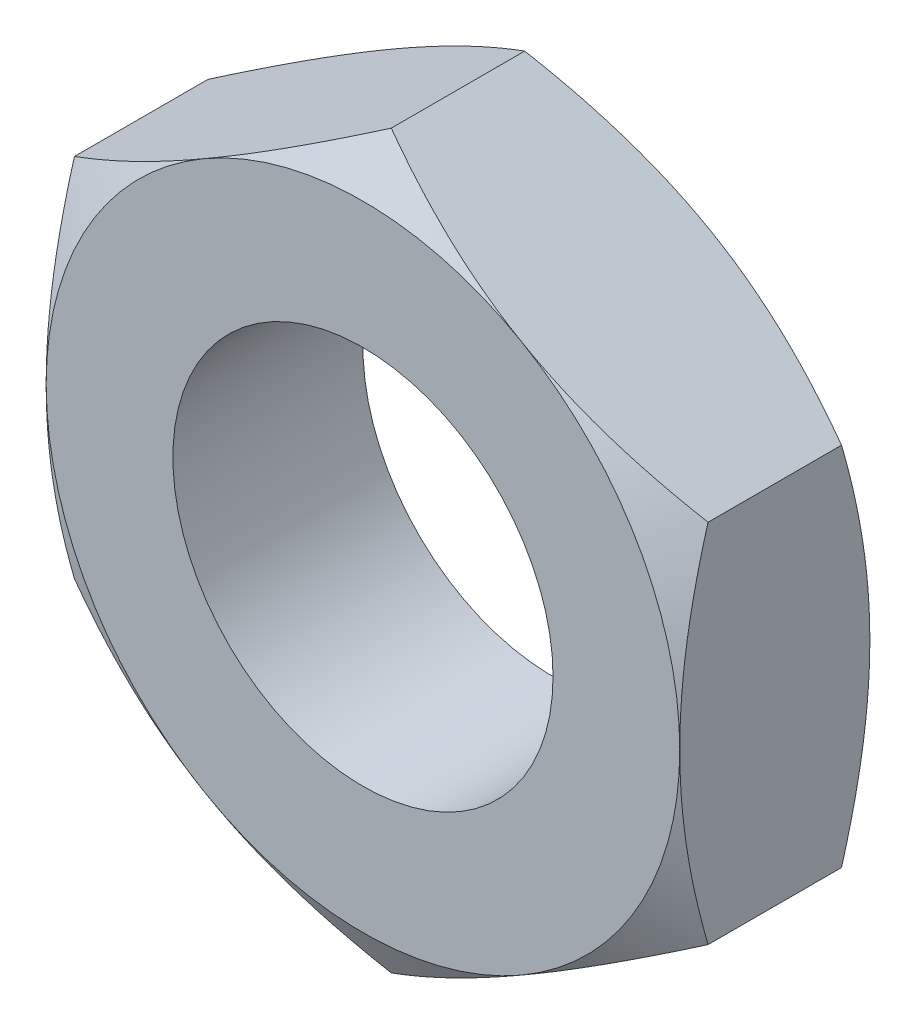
ISO-10303-21;
HEADER;
FILE_DESCRIPTION(('STEP AP214'),'2;1');
FILE_NAME('part.step','',(''),(''),'','','');
FILE_SCHEMA(('AUTOMOTIVE_DESIGN { 1 0 10303 214 1 1 1 1 }'));
ENDSEC;
DATA;
#1=APPLICATION_CONTEXT('core data for automotive mechanical design processes');
#2=APPLICATION_PROTOCOL_DEFINITION('international standard','automotive_design',2000,#1);
#3=PRODUCT_CONTEXT('',#1,'mechanical');
#4=PRODUCT('Part','Part','',(#3));
#5=PRODUCT_RELATED_PRODUCT_CATEGORY('part','',(#4));
#6=PRODUCT_DEFINITION_FORMATION('','',#4);
#7=PRODUCT_DEFINITION_CONTEXT('part definition',#1,'design');
#8=PRODUCT_DEFINITION('design','',#6,#7);
#9=PRODUCT_DEFINITION_SHAPE('','',#8);
#10=(LENGTH_UNIT() NAMED_UNIT(*) SI_UNIT(.MILLI.,.METRE.));
#11=(NAMED_UNIT(*) PLANE_ANGLE_UNIT() SI_UNIT($,.RADIAN.));
#12=(NAMED_UNIT(*) SI_UNIT($,.STERADIAN.) SOLID_ANGLE_UNIT());
#13=UNCERTAINTY_MEASURE_WITH_UNIT(LENGTH_MEASURE(1.E-05),#10,'distance_accuracy_value','');
#14=(GEOMETRIC_REPRESENTATION_CONTEXT(3) GLOBAL_UNCERTAINTY_ASSIGNED_CONTEXT((#13)) GLOBAL_UNIT_ASSIGNED_CONTEXT((#10,
#11,#12)) REPRESENTATION_CONTEXT('',''));
#15=CARTESIAN_POINT('',(0.,0.,0.));
#16=DIRECTION('',(0.,0.,1.));
#17=DIRECTION('',(1.,0.,0.));
#18=AXIS2_PLACEMENT_3D('',#15,#16,#17);
#19=CARTESIAN_POINT('',(-10.,0.,3.));
#20=DIRECTION('',(0.,0.,-1.));
#21=DIRECTION('',(-1.,0.,0.));
#22=AXIS2_PLACEMENT_3D('',#19,#20,#21);
#23=PLANE('',#22);
#24=CARTESIAN_POINT('',(0.,0.,3.));
#25=DIRECTION('',(0.,0.,-1.));
#26=DIRECTION('',(-1.,0.,0.));
#27=AXIS2_PLACEMENT_3D('',#24,#25,#26);
#28=CIRCLE('',#27,5.);
#29=CARTESIAN_POINT('',(-5.,0.,3.));
#30=VERTEX_POINT('',#29);
#31=CARTESIAN_POINT('',(-2.50000000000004,4.33012701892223,3.));
#32=VERTEX_POINT('',#31);
#33=EDGE_CURVE('E137',#30,#32,#28,.T.);
#34=ORIENTED_EDGE('',*,*,#33,.F.);
#35=CARTESIAN_POINT('',(-2.5,-4.33012701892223,3.));
#36=VERTEX_POINT('',#35);
#37=EDGE_CURVE('E119',#36,#30,#28,.T.);
#38=ORIENTED_EDGE('',*,*,#37,.F.);
#39=CARTESIAN_POINT('',(2.5,-4.33012701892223,3.));
#40=VERTEX_POINT('',#39);
#41=EDGE_CURVE('E109',#40,#36,#28,.T.);
#42=ORIENTED_EDGE('',*,*,#41,.F.);
#43=CARTESIAN_POINT('',(5.,0.,3.));
#44=VERTEX_POINT('',#43);
#45=EDGE_CURVE('E36',#44,#40,#28,.T.);
#46=ORIENTED_EDGE('',*,*,#45,.F.);
#47=CARTESIAN_POINT('',(2.50000000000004,4.33012701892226,3.));
#48=VERTEX_POINT('',#47);
#49=EDGE_CURVE('E44',#48,#44,#28,.T.);
#50=ORIENTED_EDGE('',*,*,#49,.F.);
#51=EDGE_CURVE('E139',#32,#48,#28,.T.);
#52=ORIENTED_EDGE('',*,*,#51,.F.);
#53=EDGE_LOOP('',(#34,#38,#42,#46,#50,#52));
#54=FACE_BOUND('',#53,.T.);
#55=CARTESIAN_POINT('',(0.,0.,3.));
#56=DIRECTION('',(0.,0.,1.));
#57=DIRECTION('',(1.,0.,0.));
#58=AXIS2_PLACEMENT_3D('',#55,#56,#57);
#59=CIRCLE('',#58,3.);
#60=CARTESIAN_POINT('',(3.,0.,3.));
#61=VERTEX_POINT('',#60);
#62=EDGE_CURVE('E293',#61,#61,#59,.T.);
#63=ORIENTED_EDGE('',*,*,#62,.F.);
#64=EDGE_LOOP('',(#63));
#65=FACE_BOUND('',#64,.T.);
#66=ADVANCED_FACE('F14',(#54,#65),#23,.F.);
#67=CARTESIAN_POINT('',(-10.,0.,0.));
#68=DIRECTION('',(0.,0.,-1.));
#69=DIRECTION('',(-1.,0.,0.));
#70=AXIS2_PLACEMENT_3D('',#67,#68,#69);
#71=PLANE('',#70);
#72=CARTESIAN_POINT('',(0.,0.,0.));
#73=DIRECTION('',(0.,0.,-1.));
#74=DIRECTION('',(-1.,0.,0.));
#75=AXIS2_PLACEMENT_3D('',#72,#73,#74);
#76=CIRCLE('',#75,5.);
#77=CARTESIAN_POINT('',(-2.5,-4.33012701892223,0.));
#78=VERTEX_POINT('',#77);
#79=CARTESIAN_POINT('',(-5.,0.,0.));
#80=VERTEX_POINT('',#79);
#81=EDGE_CURVE('E251',#78,#80,#76,.T.);
#82=ORIENTED_EDGE('',*,*,#81,.T.);
#83=CARTESIAN_POINT('',(-2.5,4.33012701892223,0.));
#84=VERTEX_POINT('',#83);
#85=EDGE_CURVE('E216',#80,#84,#76,.T.);
#86=ORIENTED_EDGE('',*,*,#85,.T.);
#87=CARTESIAN_POINT('',(2.50000000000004,4.33012701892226,0.));
#88=VERTEX_POINT('',#87);
#89=EDGE_CURVE('E258',#84,#88,#76,.T.);
#90=ORIENTED_EDGE('',*,*,#89,.T.);
#91=CARTESIAN_POINT('',(5.,0.,0.));
#92=VERTEX_POINT('',#91);
#93=EDGE_CURVE('E260',#88,#92,#76,.T.);
#94=ORIENTED_EDGE('',*,*,#93,.T.);
#95=CARTESIAN_POINT('',(2.5,-4.33012701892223,0.));
#96=VERTEX_POINT('',#95);
#97=EDGE_CURVE('E257',#92,#96,#76,.T.);
#98=ORIENTED_EDGE('',*,*,#97,.T.);
#99=EDGE_CURVE('E253',#96,#78,#76,.T.);
#100=ORIENTED_EDGE('',*,*,#99,.T.);
#101=EDGE_LOOP('',(#82,#86,#90,#94,#98,#100));
#102=FACE_BOUND('',#101,.T.);
#103=CARTESIAN_POINT('',(0.,0.,0.));
#104=DIRECTION('',(0.,0.,1.));
#105=DIRECTION('',(1.,0.,0.));
#106=AXIS2_PLACEMENT_3D('',#103,#104,#105);
#107=CIRCLE('',#106,3.);
#108=CARTESIAN_POINT('',(3.,0.,0.));
#109=VERTEX_POINT('',#108);
#110=EDGE_CURVE('E287',#109,#109,#107,.T.);
#111=ORIENTED_EDGE('',*,*,#110,.T.);
#112=EDGE_LOOP('',(#111));
#113=FACE_BOUND('',#112,.T.);
#114=ADVANCED_FACE('F264',(#102,#113),#71,.T.);
#115=CARTESIAN_POINT('',(-5.,-2.88675134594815,3.));
#116=DIRECTION('',(0.5,0.866025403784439,0.));
#117=DIRECTION('',(-0.866025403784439,0.5,0.));
#118=AXIS2_PLACEMENT_3D('',#115,#116,#117);
#119=PLANE('',#118);
#120=DIRECTION('',(0.,0.,-1.));
#121=VECTOR('',#120,1.);
#122=CARTESIAN_POINT('',(0.,-5.77350269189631,3.));
#123=LINE('',#122,#121);
#124=CARTESIAN_POINT('',(0.,-5.77350269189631,2.55341801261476));
#125=VERTEX_POINT('',#124);
#126=CARTESIAN_POINT('',(0.,-5.77350269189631,0.446581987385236));
#127=VERTEX_POINT('',#126);
#128=EDGE_CURVE('E133',#125,#127,#123,.T.);
#129=ORIENTED_EDGE('',*,*,#128,.F.);
#130=CARTESIAN_POINT('',(0.000200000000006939,-5.77361816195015,2.55335134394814));
#131=CARTESIAN_POINT('',(-0.219534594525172,-5.64675433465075,2.62661343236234));
#132=CARTESIAN_POINT('',(-0.441148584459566,-5.51880543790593,2.69324867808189));
#133=CARTESIAN_POINT('',(-0.8882139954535,-5.2606921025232,2.80956100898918));
#134=CARTESIAN_POINT('',(-1.11367335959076,-5.13052307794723,2.8591969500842));
#135=CARTESIAN_POINT('',(-1.5618323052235,-4.87177839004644,2.93644897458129));
#136=CARTESIAN_POINT('',(-1.78446209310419,-4.74324302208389,2.9645796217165));
#137=CARTESIAN_POINT('',(-2.11918990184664,-4.54998783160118,2.98980507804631));
#138=CARTESIAN_POINT('',(-2.23084219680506,-4.48552534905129,2.99538654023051));
#139=CARTESIAN_POINT('',(-2.4542499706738,-4.35654081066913,3.00079778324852));
#140=CARTESIAN_POINT('',(-2.56600544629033,-4.29201875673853,3.00062774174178));
#141=CARTESIAN_POINT('',(-2.87218423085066,-4.11524635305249,2.99224636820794));
#142=CARTESIAN_POINT('',(-3.06650608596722,-4.00305457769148,2.97817022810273));
#143=CARTESIAN_POINT('',(-3.45386010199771,-3.77941563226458,2.93353474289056));
#144=CARTESIAN_POINT('',(-3.64689090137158,-3.6679692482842,2.90296013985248));
#145=CARTESIAN_POINT('',(-4.03502534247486,-3.44387972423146,2.82653150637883));
#146=CARTESIAN_POINT('',(-4.23007999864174,-3.33126486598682,2.78035362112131));
#147=CARTESIAN_POINT('',(-4.61728034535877,-3.10771464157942,2.67554820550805));
#148=CARTESIAN_POINT('',(-4.80943099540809,-2.99677641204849,2.61694529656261));
#149=CARTESIAN_POINT('',(-5.0002,-2.88663587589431,2.55335134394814));
#150=B_SPLINE_CURVE_WITH_KNOTS('',3,(#130,#131,#132,#133,#134,#135,#136,#137,#138,#139,#140,
#141,#142,#143,#144,#145,#146,#147,#148,#149),.UNSPECIFIED.,.F.,.F.,(4,2,2,2,2,2,2,2,2,4),(0.,
0.792555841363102,1.58701660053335,2.36181537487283,2.74884076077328,3.13585419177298,
3.80962362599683,4.48401723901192,5.17336882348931,5.86136694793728),.UNSPECIFIED.);
#151=EDGE_CURVE('E113',#125,#36,#150,.T.);
#152=ORIENTED_EDGE('',*,*,#151,.T.);
#153=CARTESIAN_POINT('',(-5.,-2.88675134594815,2.55341801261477));
#154=VERTEX_POINT('',#153);
#155=EDGE_CURVE('E124',#36,#154,#150,.T.);
#156=ORIENTED_EDGE('',*,*,#155,.T.);
#157=DIRECTION('',(0.,0.,-1.));
#158=VECTOR('',#157,1.);
#159=CARTESIAN_POINT('',(-5.,-2.88675134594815,3.));
#160=LINE('',#159,#158);
#161=CARTESIAN_POINT('',(-5.,-2.88675134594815,0.446581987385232));
#162=VERTEX_POINT('',#161);
#163=EDGE_CURVE('E296',#154,#162,#160,.T.);
#164=ORIENTED_EDGE('',*,*,#163,.T.);
#165=CARTESIAN_POINT('',(-5.0002,-2.88663587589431,0.446648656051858));
#166=CARTESIAN_POINT('',(-4.78046540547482,-3.0134997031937,0.373386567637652));
#167=CARTESIAN_POINT('',(-4.55885141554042,-3.14144859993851,0.306751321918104));
#168=CARTESIAN_POINT('',(-4.11178600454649,-3.39956193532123,0.190438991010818));
#169=CARTESIAN_POINT('',(-3.88632664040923,-3.5297309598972,0.140803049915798));
#170=CARTESIAN_POINT('',(-3.43816769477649,-3.788475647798,0.0635510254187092));
#171=CARTESIAN_POINT('',(-3.21553790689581,-3.91701101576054,0.0354203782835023));
#172=CARTESIAN_POINT('',(-2.88081009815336,-4.11026620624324,0.0101949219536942));
#173=CARTESIAN_POINT('',(-2.76915780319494,-4.17472868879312,0.0046134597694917));
#174=CARTESIAN_POINT('',(-2.54575002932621,-4.3037132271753,-0.000797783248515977));
#175=CARTESIAN_POINT('',(-2.4339945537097,-4.36823528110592,-0.000627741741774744));
#176=CARTESIAN_POINT('',(-2.12781576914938,-4.54500768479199,0.00775363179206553));
#177=CARTESIAN_POINT('',(-1.93349391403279,-4.65719946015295,0.0218297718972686));
#178=CARTESIAN_POINT('',(-1.54613989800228,-4.88083840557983,0.0664652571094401));
#179=CARTESIAN_POINT('',(-1.35310909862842,-4.99228478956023,0.0970398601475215));
#180=CARTESIAN_POINT('',(-0.964974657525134,-5.21637431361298,0.173468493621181));
#181=CARTESIAN_POINT('',(-0.76992000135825,-5.32898917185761,0.219646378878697));
#182=CARTESIAN_POINT('',(-0.382719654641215,-5.55253939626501,0.324451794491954));
#183=CARTESIAN_POINT('',(-0.190569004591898,-5.66347762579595,0.383054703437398));
#184=CARTESIAN_POINT('',(0.000200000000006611,-5.77361816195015,0.446648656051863));
#185=B_SPLINE_CURVE_WITH_KNOTS('',3,(#165,#166,#167,#168,#169,#170,#171,#172,#173,#174,#175,
#176,#177,#178,#179,#180,#181,#182,#183,#184),.UNSPECIFIED.,.F.,.F.,(4,2,2,2,2,2,2,2,2,4),(0.,
0.792555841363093,1.58701660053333,2.3618153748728,2.74884076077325,3.13585419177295,
3.8096236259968,4.48401723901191,5.17336882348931,5.86136694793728),.UNSPECIFIED.);
#186=EDGE_CURVE('E284',#162,#78,#185,.T.);
#187=ORIENTED_EDGE('',*,*,#186,.T.);
#188=EDGE_CURVE('E282',#78,#127,#185,.T.);
#189=ORIENTED_EDGE('',*,*,#188,.T.);
#190=EDGE_LOOP('',(#129,#152,#156,#164,#187,#189));
#191=FACE_BOUND('',#190,.T.);
#192=ADVANCED_FACE('F16',(#191),#119,.F.);
#193=CARTESIAN_POINT('',(0.,-5.77350269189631,3.));
#194=DIRECTION('',(-0.5,0.866025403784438,0.));
#195=DIRECTION('',(-0.866025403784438,-0.5,0.));
#196=AXIS2_PLACEMENT_3D('',#193,#194,#195);
#197=PLANE('',#196);
#198=DIRECTION('',(0.,0.,-1.));
#199=VECTOR('',#198,1.);
#200=CARTESIAN_POINT('',(5.,-2.88675134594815,3.));
#201=LINE('',#200,#199);
#202=CARTESIAN_POINT('',(5.,-2.88675134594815,2.55341801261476));
#203=VERTEX_POINT('',#202);
#204=CARTESIAN_POINT('',(5.,-2.88675134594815,0.446581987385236));
#205=VERTEX_POINT('',#204);
#206=EDGE_CURVE('E279',#203,#205,#201,.T.);
#207=ORIENTED_EDGE('',*,*,#206,.F.);
#208=CARTESIAN_POINT('',(5.0002,-2.88663587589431,2.55335134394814));
#209=CARTESIAN_POINT('',(4.78046540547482,-3.01349970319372,2.62661343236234));
#210=CARTESIAN_POINT('',(4.55885141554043,-3.14144859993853,2.69324867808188));
#211=CARTESIAN_POINT('',(4.1117860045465,-3.39956193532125,2.80956100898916));
#212=CARTESIAN_POINT('',(3.88632664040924,-3.52973095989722,2.85919695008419));
#213=CARTESIAN_POINT('',(3.43816769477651,-3.78847564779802,2.93644897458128));
#214=CARTESIAN_POINT('',(3.21553790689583,-3.91701101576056,2.96457962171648));
#215=CARTESIAN_POINT('',(2.88081009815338,-4.11026620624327,2.98980507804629));
#216=CARTESIAN_POINT('',(2.76915780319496,-4.17472868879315,2.99538654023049));
#217=CARTESIAN_POINT('',(2.54575002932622,-4.30371322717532,3.0007977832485));
#218=CARTESIAN_POINT('',(2.43399455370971,-4.36823528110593,3.00062774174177));
#219=CARTESIAN_POINT('',(2.12781576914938,-4.54500768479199,2.99224636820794));
#220=CARTESIAN_POINT('',(1.93349391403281,-4.65719946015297,2.97817022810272));
#221=CARTESIAN_POINT('',(1.54613989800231,-4.88083840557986,2.93353474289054));
#222=CARTESIAN_POINT('',(1.35310909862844,-4.99228478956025,2.90296013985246));
#223=CARTESIAN_POINT('',(0.964974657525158,-5.216374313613,2.82653150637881));
#224=CARTESIAN_POINT('',(0.769920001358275,-5.32898917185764,2.78035362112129));
#225=CARTESIAN_POINT('',(0.38271965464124,-5.55253939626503,2.67554820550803));
#226=CARTESIAN_POINT('',(0.190569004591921,-5.66347762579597,2.61694529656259));
#227=CARTESIAN_POINT('',(-0.000199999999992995,-5.77361816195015,2.55335134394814));
#228=B_SPLINE_CURVE_WITH_KNOTS('',3,(#208,#209,#210,#211,#212,#213,#214,#215,#216,#217,#218,
#219,#220,#221,#222,#223,#224,#225,#226,#227),.UNSPECIFIED.,.F.,.F.,(4,2,2,2,2,2,2,2,2,4),(0.,
0.792555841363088,1.58701660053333,2.3618153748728,2.74884076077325,3.13585419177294,
3.80962362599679,4.48401723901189,5.17336882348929,5.86136694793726),.UNSPECIFIED.);
#229=EDGE_CURVE('E157',#203,#40,#228,.T.);
#230=ORIENTED_EDGE('',*,*,#229,.T.);
#231=EDGE_CURVE('E115',#40,#125,#228,.T.);
#232=ORIENTED_EDGE('',*,*,#231,.T.);
#233=ORIENTED_EDGE('',*,*,#128,.T.);
#234=CARTESIAN_POINT('',(-0.000199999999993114,-5.77361816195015,0.446648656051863));
#235=CARTESIAN_POINT('',(0.219534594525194,-5.64675433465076,0.373386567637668));
#236=CARTESIAN_POINT('',(0.441148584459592,-5.51880543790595,0.306751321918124));
#237=CARTESIAN_POINT('',(0.88821399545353,-5.26069210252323,0.190438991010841));
#238=CARTESIAN_POINT('',(1.11367335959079,-5.13052307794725,0.140803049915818));
#239=CARTESIAN_POINT('',(1.56183230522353,-4.87177839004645,0.0635510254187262));
#240=CARTESIAN_POINT('',(1.78446209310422,-4.74324302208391,0.0354203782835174));
#241=CARTESIAN_POINT('',(2.11918990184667,-4.5499878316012,0.0101949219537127));
#242=CARTESIAN_POINT('',(2.23084219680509,-4.48552534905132,0.00461345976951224));
#243=CARTESIAN_POINT('',(2.45424997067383,-4.35654081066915,-0.000797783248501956));
#244=CARTESIAN_POINT('',(2.56600544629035,-4.29201875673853,-0.000627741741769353));
#245=CARTESIAN_POINT('',(2.87218423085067,-4.11524635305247,0.00775363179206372));
#246=CARTESIAN_POINT('',(3.06650608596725,-4.0030545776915,0.02182977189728));
#247=CARTESIAN_POINT('',(3.45386010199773,-3.77941563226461,0.0664652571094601));
#248=CARTESIAN_POINT('',(3.6468909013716,-3.66796924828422,0.0970398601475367));
#249=CARTESIAN_POINT('',(4.03502534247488,-3.44387972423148,0.173468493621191));
#250=CARTESIAN_POINT('',(4.23007999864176,-3.33126486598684,0.219646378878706));
#251=CARTESIAN_POINT('',(4.61728034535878,-3.10771464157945,0.324451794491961));
#252=CARTESIAN_POINT('',(4.8094309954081,-2.99677641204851,0.383054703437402));
#253=CARTESIAN_POINT('',(5.0002,-2.88663587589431,0.446648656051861));
#254=B_SPLINE_CURVE_WITH_KNOTS('',3,(#234,#235,#236,#237,#238,#239,#240,#241,#242,#243,#244,
#245,#246,#247,#248,#249,#250,#251,#252,#253),.UNSPECIFIED.,.F.,.F.,(4,2,2,2,2,2,2,2,2,4),(0.,
0.7925558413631,1.58701660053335,2.36181537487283,2.74884076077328,3.13585419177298,
3.80962362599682,4.48401723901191,5.1733688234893,5.86136694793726),.UNSPECIFIED.);
#255=EDGE_CURVE('E280',#127,#96,#254,.T.);
#256=ORIENTED_EDGE('',*,*,#255,.T.);
#257=EDGE_CURVE('E232',#96,#205,#254,.T.);
#258=ORIENTED_EDGE('',*,*,#257,.T.);
#259=EDGE_LOOP('',(#207,#230,#232,#233,#256,#258));
#260=FACE_BOUND('',#259,.T.);
#261=ADVANCED_FACE('F241',(#260),#197,.F.);
#262=CARTESIAN_POINT('',(5.,-2.88675134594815,3.));
#263=DIRECTION('',(-1.,0.,0.));
#264=DIRECTION('',(0.,-1.,0.));
#265=AXIS2_PLACEMENT_3D('',#262,#263,#264);
#266=PLANE('',#265);
#267=DIRECTION('',(0.,0.,-1.));
#268=VECTOR('',#267,1.);
#269=CARTESIAN_POINT('',(5.,2.88675134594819,3.));
#270=LINE('',#269,#268);
#271=CARTESIAN_POINT('',(5.,2.88675134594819,2.55341801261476));
#272=VERTEX_POINT('',#271);
#273=CARTESIAN_POINT('',(5.,2.88675134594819,0.446581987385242));
#274=VERTEX_POINT('',#273);
#275=EDGE_CURVE('E303',#272,#274,#270,.T.);
#276=ORIENTED_EDGE('',*,*,#275,.F.);
#277=CARTESIAN_POINT('',(5.,-7.70435628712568,0.584012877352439));
#278=CARTESIAN_POINT('',(5.,-7.48638862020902,0.689545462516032));
#279=CARTESIAN_POINT('',(5.00000000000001,-7.26791520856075,0.79405164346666));
#280=CARTESIAN_POINT('',(5.00000000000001,-6.8296877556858,1.0004329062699));
#281=CARTESIAN_POINT('',(5.00000000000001,-6.60993351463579,1.10230756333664));
#282=CARTESIAN_POINT('',(5.,-6.1677188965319,1.30337074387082));
#283=CARTESIAN_POINT('',(5.,-5.94525026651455,1.40254117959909));
#284=CARTESIAN_POINT('',(5.,-5.49852605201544,1.596756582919));
#285=CARTESIAN_POINT('',(5.,-5.27427055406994,1.69180174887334));
#286=CARTESIAN_POINT('',(5.,-4.81656719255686,1.87956746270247));
#287=CARTESIAN_POINT('',(5.,-4.5830510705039,1.97212254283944));
#288=CARTESIAN_POINT('',(5.,-4.11326842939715,2.15010633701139));
#289=CARTESIAN_POINT('',(5.,-3.8770016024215,2.23553424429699));
#290=CARTESIAN_POINT('',(5.,-3.40180035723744,2.39698443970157));
#291=CARTESIAN_POINT('',(5.,-3.16287262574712,2.47302620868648));
#292=CARTESIAN_POINT('',(5.,-2.68159049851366,2.61323118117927));
#293=CARTESIAN_POINT('',(5.,-2.43923722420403,2.6773981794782));
#294=CARTESIAN_POINT('',(5.,-1.95230484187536,2.79040234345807));
#295=CARTESIAN_POINT('',(5.,-1.70774498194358,2.83932090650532));
#296=CARTESIAN_POINT('',(5.,-1.2156368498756,2.91902977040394));
#297=CARTESIAN_POINT('',(5.,-0.968088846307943,2.94982168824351));
#298=CARTESIAN_POINT('',(5.,-0.474452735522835,2.99041678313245));
#299=CARTESIAN_POINT('',(5.,-0.228387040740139,3.00048579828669));
#300=CARTESIAN_POINT('',(5.,0.263719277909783,2.99947816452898));
#301=CARTESIAN_POINT('',(5.,0.509759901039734,2.98840101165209));
#302=CARTESIAN_POINT('',(5.,0.928963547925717,2.95228919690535));
#303=CARTESIAN_POINT('',(5.,1.10258008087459,2.93223058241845));
#304=CARTESIAN_POINT('',(4.99999999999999,1.44850164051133,2.88286018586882));
#305=CARTESIAN_POINT('',(4.99999999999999,1.6208064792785,2.85354710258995));
#306=CARTESIAN_POINT('',(5.,2.13554732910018,2.75327119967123));
#307=CARTESIAN_POINT('',(4.99999999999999,2.47560842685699,2.66999132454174));
#308=CARTESIAN_POINT('',(4.99999999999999,2.98401548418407,2.52610224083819));
#309=CARTESIAN_POINT('',(4.99999999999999,3.15500999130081,2.47432265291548));
#310=CARTESIAN_POINT('',(4.99999999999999,3.49533709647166,2.36551539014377));
#311=CARTESIAN_POINT('',(4.99999999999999,3.66466968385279,2.30848768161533));
#312=CARTESIAN_POINT('',(4.99999999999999,4.00172905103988,2.1900884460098));
#313=CARTESIAN_POINT('',(4.99999999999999,4.16945636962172,2.12871843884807));
#314=CARTESIAN_POINT('',(4.99999999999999,4.50353028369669,2.00234359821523));
#315=CARTESIAN_POINT('',(5.,4.66987689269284,1.93733880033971));
#316=CARTESIAN_POINT('',(5.,5.05103159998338,1.7843571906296));
#317=CARTESIAN_POINT('',(4.99999999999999,5.2654193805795,1.69533532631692));
#318=CARTESIAN_POINT('',(4.99999999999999,5.69246162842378,1.51321637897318));
#319=CARTESIAN_POINT('',(4.99999999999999,5.90511600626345,1.42011908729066));
#320=CARTESIAN_POINT('',(4.99999999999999,6.32899635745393,1.23063721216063));
#321=CARTESIAN_POINT('',(4.99999999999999,6.54022207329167,1.13425205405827));
#322=CARTESIAN_POINT('',(4.99999999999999,6.9614414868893,0.938822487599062));
#323=CARTESIAN_POINT('',(4.99999999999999,7.17143516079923,0.839778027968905));
#324=CARTESIAN_POINT('',(4.99999999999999,7.80023947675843,0.539224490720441));
#325=CARTESIAN_POINT('',(4.99999999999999,8.21749619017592,0.334466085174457));
#326=CARTESIAN_POINT('',(4.99999999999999,9.04903998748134,-0.0809933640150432));
#327=CARTESIAN_POINT('',(4.99999999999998,9.46332696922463,-0.291694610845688));
#328=CARTESIAN_POINT('',(4.99999999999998,10.0666982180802,-0.602498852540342));
#329=CARTESIAN_POINT('',(4.99999999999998,10.2566518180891,-0.700919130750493));
#330=CARTESIAN_POINT('',(4.99999999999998,10.6361445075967,-0.898547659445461));
#331=CARTESIAN_POINT('',(4.99999999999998,10.8256836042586,-0.99775589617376));
#332=CARTESIAN_POINT('',(4.99999999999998,11.3937758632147,-1.29641369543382));
#333=CARTESIAN_POINT('',(4.99999999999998,11.771789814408,-1.49688902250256));
#334=CARTESIAN_POINT('',(4.99999999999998,12.5258364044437,-1.89947578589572));
#335=CARTESIAN_POINT('',(4.99999999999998,12.9018715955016,-2.10158245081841));
#336=CARTESIAN_POINT('',(4.99999999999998,13.6530235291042,-2.50745083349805));
#337=CARTESIAN_POINT('',(4.99999999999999,14.0281403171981,-2.71121246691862));
#338=CARTESIAN_POINT('',(5.,14.4029155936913,-2.91559640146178));
#339=B_SPLINE_CURVE_WITH_KNOTS('',3,(#277,#278,#279,#280,#281,#282,#283,#284,#285,#286,#287,
#288,#289,#290,#291,#292,#293,#294,#295,#296,#297,#298,#299,#300,#301,#302,#303,#304,#305,#306,
#307,#308,#309,#310,#311,#312,#313,#314,#315,#316,#317,#318,#319,#320,#321,#322,#323,#324,#325,
#326,#327,#328,#329,#330,#331,#332,#333,#334,#335,#336,#337,#338),.UNSPECIFIED.,.F.,.F.,(4,2,2,
2,2,2,2,2,2,2,2,2,2,2,2,2,2,2,2,2,2,2,2,2,2,2,2,2,2,2,4),(0.,0.726523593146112,1.45316373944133,
2.18384467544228,2.91449043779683,3.66796939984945,4.42153353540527,5.17350637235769,
5.92523848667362,6.672886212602,7.42046723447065,8.15839678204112,8.89634391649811,
9.42040292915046,9.94453565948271,10.9934049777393,11.5293484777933,12.0652954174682,
12.601055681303,13.1368106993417,13.8331624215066,14.5295498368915,15.2260595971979,
15.922582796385,17.3168712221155,18.7112073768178,19.3530160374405,19.9948135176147,
21.2784563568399,22.5591730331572,23.8398248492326),.UNSPECIFIED.);
#340=EDGE_CURVE('E153',#272,#44,#339,.F.);
#341=ORIENTED_EDGE('',*,*,#340,.T.);
#342=EDGE_CURVE('E156',#44,#203,#339,.F.);
#343=ORIENTED_EDGE('',*,*,#342,.T.);
#344=ORIENTED_EDGE('',*,*,#206,.T.);
#345=CARTESIAN_POINT('',(5.,-7.70435628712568,2.41598712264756));
#346=CARTESIAN_POINT('',(5.,-7.48638862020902,2.31045453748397));
#347=CARTESIAN_POINT('',(5.00000000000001,-7.26791520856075,2.20594835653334));
#348=CARTESIAN_POINT('',(5.00000000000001,-6.82968775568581,1.9995670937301));
#349=CARTESIAN_POINT('',(5.00000000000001,-6.60993351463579,1.89769243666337));
#350=CARTESIAN_POINT('',(5.,-6.1677188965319,1.69662925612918));
#351=CARTESIAN_POINT('',(5.,-5.94525026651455,1.59745882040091));
#352=CARTESIAN_POINT('',(5.,-5.49852605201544,1.403243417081));
#353=CARTESIAN_POINT('',(5.,-5.27427055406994,1.30819825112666));
#354=CARTESIAN_POINT('',(5.,-4.81656719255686,1.12043253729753));
#355=CARTESIAN_POINT('',(5.,-4.5830510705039,1.02787745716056));
#356=CARTESIAN_POINT('',(5.,-4.11326842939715,0.84989366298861));
#357=CARTESIAN_POINT('',(5.,-3.8770016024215,0.764465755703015));
#358=CARTESIAN_POINT('',(5.,-3.40180035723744,0.60301556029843));
#359=CARTESIAN_POINT('',(5.,-3.16287262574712,0.526973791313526));
#360=CARTESIAN_POINT('',(5.,-2.68159049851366,0.386768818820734));
#361=CARTESIAN_POINT('',(5.,-2.43923722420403,0.322601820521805));
#362=CARTESIAN_POINT('',(5.,-1.95230484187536,0.209597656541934));
#363=CARTESIAN_POINT('',(5.,-1.70774498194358,0.160679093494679));
#364=CARTESIAN_POINT('',(5.,-1.2156368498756,0.0809702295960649));
#365=CARTESIAN_POINT('',(5.,-0.968088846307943,0.050178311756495));
#366=CARTESIAN_POINT('',(5.,-0.474452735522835,0.00958321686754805));
#367=CARTESIAN_POINT('',(5.,-0.228387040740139,-0.000485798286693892));
#368=CARTESIAN_POINT('',(5.,0.263719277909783,0.000521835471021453));
#369=CARTESIAN_POINT('',(5.,0.509759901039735,0.0115989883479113));
#370=CARTESIAN_POINT('',(5.,0.928963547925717,0.0477108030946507));
#371=CARTESIAN_POINT('',(5.,1.10258008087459,0.0677694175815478));
#372=CARTESIAN_POINT('',(4.99999999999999,1.44850164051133,0.117139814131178));
#373=CARTESIAN_POINT('',(4.99999999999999,1.6208064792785,0.146452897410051));
#374=CARTESIAN_POINT('',(5.,2.13554732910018,0.246728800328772));
#375=CARTESIAN_POINT('',(4.99999999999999,2.47560842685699,0.330008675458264));
#376=CARTESIAN_POINT('',(4.99999999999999,2.98401548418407,0.473897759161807));
#377=CARTESIAN_POINT('',(4.99999999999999,3.15500999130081,0.525677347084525));
#378=CARTESIAN_POINT('',(4.99999999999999,3.49533709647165,0.634484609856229));
#379=CARTESIAN_POINT('',(4.99999999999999,3.66466968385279,0.691512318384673));
#380=CARTESIAN_POINT('',(4.99999999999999,4.00172905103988,0.809911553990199));
#381=CARTESIAN_POINT('',(4.99999999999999,4.16945636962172,0.871281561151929));
#382=CARTESIAN_POINT('',(4.99999999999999,4.50353028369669,0.997656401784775));
#383=CARTESIAN_POINT('',(5.,4.66987689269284,1.06266119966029));
#384=CARTESIAN_POINT('',(5.,5.05103159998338,1.2156428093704));
#385=CARTESIAN_POINT('',(4.99999999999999,5.2654193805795,1.30466467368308));
#386=CARTESIAN_POINT('',(4.99999999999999,5.69246162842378,1.48678362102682));
#387=CARTESIAN_POINT('',(4.99999999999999,5.90511600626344,1.57988091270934));
#388=CARTESIAN_POINT('',(4.99999999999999,6.32899635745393,1.76936278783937));
#389=CARTESIAN_POINT('',(4.99999999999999,6.54022207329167,1.86574794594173));
#390=CARTESIAN_POINT('',(4.99999999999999,6.96144148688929,2.06117751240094));
#391=CARTESIAN_POINT('',(4.99999999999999,7.17143516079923,2.16022197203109));
#392=CARTESIAN_POINT('',(4.99999999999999,7.80023947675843,2.46077550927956));
#393=CARTESIAN_POINT('',(4.99999999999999,8.21749619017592,2.66553391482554));
#394=CARTESIAN_POINT('',(4.99999999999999,9.04903998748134,3.08099336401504));
#395=CARTESIAN_POINT('',(4.99999999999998,9.46332696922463,3.29169461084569));
#396=CARTESIAN_POINT('',(4.99999999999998,10.0666982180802,3.60249885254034));
#397=CARTESIAN_POINT('',(4.99999999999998,10.2566518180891,3.70091913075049));
#398=CARTESIAN_POINT('',(4.99999999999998,10.6361445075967,3.89854765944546));
#399=CARTESIAN_POINT('',(4.99999999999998,10.8256836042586,3.99775589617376));
#400=CARTESIAN_POINT('',(4.99999999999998,11.3937758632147,4.29641369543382));
#401=CARTESIAN_POINT('',(4.99999999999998,11.771789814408,4.49688902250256));
#402=CARTESIAN_POINT('',(4.99999999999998,12.5258364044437,4.89947578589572));
#403=CARTESIAN_POINT('',(4.99999999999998,12.9018715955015,5.10158245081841));
#404=CARTESIAN_POINT('',(4.99999999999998,13.6530235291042,5.50745083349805));
#405=CARTESIAN_POINT('',(4.99999999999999,14.0281403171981,5.71121246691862));
#406=CARTESIAN_POINT('',(5.,14.4029155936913,5.91559640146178));
#407=B_SPLINE_CURVE_WITH_KNOTS('',3,(#345,#346,#347,#348,#349,#350,#351,#352,#353,#354,#355,
#356,#357,#358,#359,#360,#361,#362,#363,#364,#365,#366,#367,#368,#369,#370,#371,#372,#373,#374,
#375,#376,#377,#378,#379,#380,#381,#382,#383,#384,#385,#386,#387,#388,#389,#390,#391,#392,#393,
#394,#395,#396,#397,#398,#399,#400,#401,#402,#403,#404,#405,#406),.UNSPECIFIED.,.F.,.F.,(4,2,2,
2,2,2,2,2,2,2,2,2,2,2,2,2,2,2,2,2,2,2,2,2,2,2,2,2,2,2,4),(0.,0.726523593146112,1.45316373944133,
2.18384467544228,2.91449043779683,3.66796939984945,4.42153353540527,5.17350637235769,
5.92523848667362,6.672886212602,7.42046723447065,8.15839678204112,8.89634391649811,
9.42040292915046,9.94453565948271,10.9934049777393,11.5293484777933,12.0652954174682,
12.601055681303,13.1368106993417,13.8331624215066,14.5295498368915,15.2260595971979,
15.922582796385,17.3168712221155,18.7112073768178,19.3530160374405,19.9948135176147,
21.2784563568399,22.5591730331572,23.8398248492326),.UNSPECIFIED.);
#408=EDGE_CURVE('E231',#205,#92,#407,.T.);
#409=ORIENTED_EDGE('',*,*,#408,.T.);
#410=EDGE_CURVE('E224',#92,#274,#407,.T.);
#411=ORIENTED_EDGE('',*,*,#410,.T.);
#412=EDGE_LOOP('',(#276,#341,#343,#344,#409,#411));
#413=FACE_BOUND('',#412,.T.);
#414=ADVANCED_FACE('F238',(#413),#266,.F.);
#415=CARTESIAN_POINT('',(5.,2.88675134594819,3.));
#416=DIRECTION('',(-0.5,-0.866025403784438,0.));
#417=DIRECTION('',(0.866025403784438,-0.5,0.));
#418=AXIS2_PLACEMENT_3D('',#415,#416,#417);
#419=PLANE('',#418);
#420=DIRECTION('',(0.,0.,-1.));
#421=VECTOR('',#420,1.);
#422=CARTESIAN_POINT('',(0.,5.77350269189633,3.));
#423=LINE('',#422,#421);
#424=CARTESIAN_POINT('',(0.,5.77350269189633,2.55341801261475));
#425=VERTEX_POINT('',#424);
#426=CARTESIAN_POINT('',(0.,5.77350269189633,0.446581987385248));
#427=VERTEX_POINT('',#426);
#428=EDGE_CURVE('E162',#425,#427,#423,.T.);
#429=ORIENTED_EDGE('',*,*,#428,.F.);
#430=CARTESIAN_POINT('',(-0.000199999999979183,5.77361816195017,2.55335134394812));
#431=CARTESIAN_POINT('',(0.219534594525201,5.64675433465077,2.62661343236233));
#432=CARTESIAN_POINT('',(0.441148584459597,5.51880543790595,2.69324867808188));
#433=CARTESIAN_POINT('',(0.888213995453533,5.26069210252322,2.80956100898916));
#434=CARTESIAN_POINT('',(1.1136733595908,5.13052307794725,2.85919695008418));
#435=CARTESIAN_POINT('',(1.56183230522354,4.87177839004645,2.93644897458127));
#436=CARTESIAN_POINT('',(1.78446209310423,4.74324302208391,2.96457962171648));
#437=CARTESIAN_POINT('',(2.11918990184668,4.5499878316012,2.98980507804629));
#438=CARTESIAN_POINT('',(2.2308421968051,4.48552534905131,2.99538654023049));
#439=CARTESIAN_POINT('',(2.45424997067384,4.35654081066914,3.0007977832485));
#440=CARTESIAN_POINT('',(2.56600544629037,4.29201875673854,3.00062774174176));
#441=CARTESIAN_POINT('',(2.8721842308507,4.1152463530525,2.99224636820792));
#442=CARTESIAN_POINT('',(3.06650608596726,4.0030545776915,2.97817022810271));
#443=CARTESIAN_POINT('',(3.45386010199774,3.7794156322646,2.93353474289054));
#444=CARTESIAN_POINT('',(3.6468909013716,3.66796924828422,2.90296013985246));
#445=CARTESIAN_POINT('',(4.03502534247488,3.44387972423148,2.82653150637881));
#446=CARTESIAN_POINT('',(4.23007999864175,3.33126486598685,2.7803536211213));
#447=CARTESIAN_POINT('',(4.61728034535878,3.10771464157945,2.67554820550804));
#448=CARTESIAN_POINT('',(4.80943099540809,2.99677641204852,2.6169452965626));
#449=CARTESIAN_POINT('',(5.0002,2.88663587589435,2.55335134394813));
#450=B_SPLINE_CURVE_WITH_KNOTS('',3,(#430,#431,#432,#433,#434,#435,#436,#437,#438,#439,#440,
#441,#442,#443,#444,#445,#446,#447,#448,#449),.UNSPECIFIED.,.F.,.F.,(4,2,2,2,2,2,2,2,2,4),(0.,
0.792555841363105,1.58701660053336,2.36181537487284,2.7488407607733,3.135854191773,
3.80962362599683,4.48401723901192,5.17336882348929,5.86136694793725),.UNSPECIFIED.);
#451=EDGE_CURVE('E147',#425,#48,#450,.T.);
#452=ORIENTED_EDGE('',*,*,#451,.T.);
#453=EDGE_CURVE('E150',#48,#272,#450,.T.);
#454=ORIENTED_EDGE('',*,*,#453,.T.);
#455=ORIENTED_EDGE('',*,*,#275,.T.);
#456=CARTESIAN_POINT('',(5.0002,2.88663587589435,0.446648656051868));
#457=CARTESIAN_POINT('',(4.78046540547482,3.01349970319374,0.373386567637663));
#458=CARTESIAN_POINT('',(4.55885141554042,3.14144859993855,0.306751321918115));
#459=CARTESIAN_POINT('',(4.11178600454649,3.39956193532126,0.190438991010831));
#460=CARTESIAN_POINT('',(3.88632664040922,3.52973095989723,0.140803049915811));
#461=CARTESIAN_POINT('',(3.43816769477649,3.78847564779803,0.063551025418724));
#462=CARTESIAN_POINT('',(3.21553790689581,3.91701101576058,0.0354203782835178));
#463=CARTESIAN_POINT('',(2.88081009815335,4.11026620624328,0.010194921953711));
#464=CARTESIAN_POINT('',(2.76915780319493,4.17472868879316,0.00461345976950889));
#465=CARTESIAN_POINT('',(2.5457500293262,4.30371322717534,-0.000797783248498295));
#466=CARTESIAN_POINT('',(2.43399455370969,4.36823528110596,-0.000627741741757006));
#467=CARTESIAN_POINT('',(2.12781576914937,4.54500768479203,0.00775363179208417));
#468=CARTESIAN_POINT('',(1.93349391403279,4.65719946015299,0.0218297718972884));
#469=CARTESIAN_POINT('',(1.54613989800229,4.88083840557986,0.0664652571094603));
#470=CARTESIAN_POINT('',(1.35310909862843,4.99228478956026,0.0970398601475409));
#471=CARTESIAN_POINT('',(0.964974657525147,5.21637431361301,0.173468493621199));
#472=CARTESIAN_POINT('',(0.769920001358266,5.32898917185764,0.219646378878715));
#473=CARTESIAN_POINT('',(0.382719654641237,5.55253939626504,0.32445179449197));
#474=CARTESIAN_POINT('',(0.190569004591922,5.66347762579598,0.383054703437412));
#475=CARTESIAN_POINT('',(-0.000199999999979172,5.77361816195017,0.446648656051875));
#476=B_SPLINE_CURVE_WITH_KNOTS('',3,(#456,#457,#458,#459,#460,#461,#462,#463,#464,#465,#466,
#467,#468,#469,#470,#471,#472,#473,#474,#475),.UNSPECIFIED.,.F.,.F.,(4,2,2,2,2,2,2,2,2,4),(0.,
0.792555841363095,1.58701660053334,2.36181537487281,2.74884076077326,3.13585419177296,
3.8096236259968,4.4840172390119,5.17336882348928,5.86136694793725),.UNSPECIFIED.);
#477=EDGE_CURVE('E223',#274,#88,#476,.T.);
#478=ORIENTED_EDGE('',*,*,#477,.T.);
#479=EDGE_CURVE('E217',#88,#427,#476,.T.);
#480=ORIENTED_EDGE('',*,*,#479,.T.);
#481=EDGE_LOOP('',(#429,#452,#454,#455,#478,#480));
#482=FACE_BOUND('',#481,.T.);
#483=ADVANCED_FACE('F160',(#482),#419,.F.);
#484=CARTESIAN_POINT('',(0.,5.77350269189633,3.));
#485=DIRECTION('',(0.5,-0.866025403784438,0.));
#486=DIRECTION('',(0.866025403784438,0.5,0.));
#487=AXIS2_PLACEMENT_3D('',#484,#485,#486);
#488=PLANE('',#487);
#489=DIRECTION('',(0.,0.,-1.));
#490=VECTOR('',#489,1.);
#491=CARTESIAN_POINT('',(-5.,2.88675134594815,3.));
#492=LINE('',#491,#490);
#493=CARTESIAN_POINT('',(-5.,2.88675134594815,2.55341801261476));
#494=VERTEX_POINT('',#493);
#495=CARTESIAN_POINT('',(-5.,2.88675134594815,0.446581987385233));
#496=VERTEX_POINT('',#495);
#497=EDGE_CURVE('E300',#494,#496,#492,.T.);
#498=ORIENTED_EDGE('',*,*,#497,.F.);
#499=CARTESIAN_POINT('',(-5.0002,2.88663587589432,2.55335134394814));
#500=CARTESIAN_POINT('',(-4.78046540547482,3.01349970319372,2.62661343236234));
#501=CARTESIAN_POINT('',(-4.55885141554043,3.14144859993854,2.69324867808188));
#502=CARTESIAN_POINT('',(-4.1117860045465,3.39956193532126,2.80956100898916));
#503=CARTESIAN_POINT('',(-3.88632664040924,3.52973095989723,2.85919695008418));
#504=CARTESIAN_POINT('',(-3.43816769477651,3.78847564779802,2.93644897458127));
#505=CARTESIAN_POINT('',(-3.21553790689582,3.91701101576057,2.96457962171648));
#506=CARTESIAN_POINT('',(-2.88081009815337,4.11026620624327,2.98980507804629));
#507=CARTESIAN_POINT('',(-2.76915780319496,4.17472868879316,2.99538654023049));
#508=CARTESIAN_POINT('',(-2.54575002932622,4.30371322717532,3.0007977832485));
#509=CARTESIAN_POINT('',(-2.4339945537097,4.36823528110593,3.00062774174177));
#510=CARTESIAN_POINT('',(-2.12781576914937,4.54500768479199,2.99224636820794));
#511=CARTESIAN_POINT('',(-1.9334939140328,4.65719946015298,2.97817022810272));
#512=CARTESIAN_POINT('',(-1.5461398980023,4.88083840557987,2.93353474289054));
#513=CARTESIAN_POINT('',(-1.35310909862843,4.99228478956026,2.90296013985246));
#514=CARTESIAN_POINT('',(-0.96497465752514,5.21637431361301,2.8265315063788));
#515=CARTESIAN_POINT('',(-0.769920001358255,5.32898917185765,2.78035362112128));
#516=CARTESIAN_POINT('',(-0.382719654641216,5.55253939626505,2.67554820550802));
#517=CARTESIAN_POINT('',(-0.190569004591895,5.66347762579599,2.61694529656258));
#518=CARTESIAN_POINT('',(0.000200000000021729,5.77361816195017,2.55335134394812));
#519=B_SPLINE_CURVE_WITH_KNOTS('',3,(#499,#500,#501,#502,#503,#504,#505,#506,#507,#508,#509,
#510,#511,#512,#513,#514,#515,#516,#517,#518),.UNSPECIFIED.,.F.,.F.,(4,2,2,2,2,2,2,2,2,4),(0.,
0.79255584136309,1.58701660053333,2.3618153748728,2.74884076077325,3.13585419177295,
3.8096236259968,4.48401723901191,5.17336882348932,5.8613669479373),.UNSPECIFIED.);
#520=EDGE_CURVE('E129',#494,#32,#519,.T.);
#521=ORIENTED_EDGE('',*,*,#520,.T.);
#522=EDGE_CURVE('E134',#32,#425,#519,.T.);
#523=ORIENTED_EDGE('',*,*,#522,.T.);
#524=ORIENTED_EDGE('',*,*,#428,.T.);
#525=CARTESIAN_POINT('',(0.000200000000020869,5.77361816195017,0.446648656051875));
#526=CARTESIAN_POINT('',(-0.219534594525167,5.64675433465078,0.373386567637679));
#527=CARTESIAN_POINT('',(-0.441148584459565,5.51880543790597,0.306751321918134));
#528=CARTESIAN_POINT('',(-0.888213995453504,5.26069210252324,0.190438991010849));
#529=CARTESIAN_POINT('',(-1.11367335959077,5.13052307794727,0.140803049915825));
#530=CARTESIAN_POINT('',(-1.56183230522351,4.87177839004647,0.0635510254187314));
#531=CARTESIAN_POINT('',(-1.7844620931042,4.74324302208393,0.0354203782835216));
#532=CARTESIAN_POINT('',(-2.11918990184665,4.54998783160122,0.0101949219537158));
#533=CARTESIAN_POINT('',(-2.23084219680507,4.48552534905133,0.00461345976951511));
#534=CARTESIAN_POINT('',(-2.45424997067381,4.35654081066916,-0.000797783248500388));
#535=CARTESIAN_POINT('',(-2.56600544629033,4.29201875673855,-0.000627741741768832));
#536=CARTESIAN_POINT('',(-2.87218423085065,4.11524635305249,0.00775363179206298));
#537=CARTESIAN_POINT('',(-3.06650608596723,4.00305457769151,0.0218297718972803));
#538=CARTESIAN_POINT('',(-3.45386010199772,3.77941563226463,0.0664652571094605));
#539=CARTESIAN_POINT('',(-3.64689090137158,3.66796924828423,0.0970398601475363));
#540=CARTESIAN_POINT('',(-4.03502534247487,3.44387972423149,0.17346849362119));
#541=CARTESIAN_POINT('',(-4.23007999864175,3.33126486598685,0.219646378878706));
#542=CARTESIAN_POINT('',(-4.61728034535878,3.10771464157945,0.324451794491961));
#543=CARTESIAN_POINT('',(-4.8094309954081,2.99677641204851,0.383054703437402));
#544=CARTESIAN_POINT('',(-5.0002,2.88663587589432,0.446648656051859));
#545=B_SPLINE_CURVE_WITH_KNOTS('',3,(#525,#526,#527,#528,#529,#530,#531,#532,#533,#534,#535,
#536,#537,#538,#539,#540,#541,#542,#543,#544),.UNSPECIFIED.,.F.,.F.,(4,2,2,2,2,2,2,2,2,4),(0.,
0.792555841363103,1.58701660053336,2.36181537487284,2.74884076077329,3.13585419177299,
3.80962362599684,4.48401723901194,5.17336882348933,5.86136694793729),.UNSPECIFIED.);
#546=EDGE_CURVE('E215',#427,#84,#545,.T.);
#547=ORIENTED_EDGE('',*,*,#546,.T.);
#548=EDGE_CURVE('E207',#84,#496,#545,.T.);
#549=ORIENTED_EDGE('',*,*,#548,.T.);
#550=EDGE_LOOP('',(#498,#521,#523,#524,#547,#549));
#551=FACE_BOUND('',#550,.T.);
#552=ADVANCED_FACE('F198',(#551),#488,.F.);
#553=CARTESIAN_POINT('',(-5.,2.88675134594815,3.));
#554=DIRECTION('',(1.,0.,0.));
#555=DIRECTION('',(0.,0.,-1.));
#556=AXIS2_PLACEMENT_3D('',#553,#554,#555);
#557=PLANE('',#556);
#558=ORIENTED_EDGE('',*,*,#163,.F.);
#559=CARTESIAN_POINT('',(-5.,-7.70435628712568,0.584012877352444));
#560=CARTESIAN_POINT('',(-5.,-7.48638862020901,0.689545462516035));
#561=CARTESIAN_POINT('',(-5.,-7.26791520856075,0.794051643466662));
#562=CARTESIAN_POINT('',(-5.,-6.8296877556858,1.0004329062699));
#563=CARTESIAN_POINT('',(-5.,-6.60993351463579,1.10230756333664));
#564=CARTESIAN_POINT('',(-5.,-6.1677188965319,1.30337074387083));
#565=CARTESIAN_POINT('',(-5.,-5.94525026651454,1.40254117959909));
#566=CARTESIAN_POINT('',(-5.,-5.49852605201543,1.596756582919));
#567=CARTESIAN_POINT('',(-5.,-5.27427055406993,1.69180174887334));
#568=CARTESIAN_POINT('',(-5.,-4.81656719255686,1.87956746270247));
#569=CARTESIAN_POINT('',(-5.,-4.5830510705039,1.97212254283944));
#570=CARTESIAN_POINT('',(-5.,-4.11326842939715,2.15010633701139));
#571=CARTESIAN_POINT('',(-5.,-3.87700160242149,2.23553424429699));
#572=CARTESIAN_POINT('',(-5.,-3.40180035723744,2.39698443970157));
#573=CARTESIAN_POINT('',(-5.,-3.16287262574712,2.47302620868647));
#574=CARTESIAN_POINT('',(-5.,-2.68159049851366,2.61323118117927));
#575=CARTESIAN_POINT('',(-5.,-2.43923722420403,2.6773981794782));
#576=CARTESIAN_POINT('',(-5.,-1.95230484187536,2.79040234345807));
#577=CARTESIAN_POINT('',(-5.,-1.70774498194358,2.83932090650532));
#578=CARTESIAN_POINT('',(-5.,-1.2156368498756,2.91902977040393));
#579=CARTESIAN_POINT('',(-5.,-0.968088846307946,2.9498216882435));
#580=CARTESIAN_POINT('',(-5.,-0.474452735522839,2.99041678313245));
#581=CARTESIAN_POINT('',(-5.,-0.228387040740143,3.00048579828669));
#582=CARTESIAN_POINT('',(-5.,0.263719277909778,2.99947816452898));
#583=CARTESIAN_POINT('',(-5.,0.509759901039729,2.98840101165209));
#584=CARTESIAN_POINT('',(-5.,0.92896354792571,2.95228919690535));
#585=CARTESIAN_POINT('',(-5.,1.10258008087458,2.93223058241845));
#586=CARTESIAN_POINT('',(-5.,1.44850164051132,2.88286018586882));
#587=CARTESIAN_POINT('',(-5.,1.6208064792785,2.85354710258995));
#588=CARTESIAN_POINT('',(-5.,2.13554732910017,2.75327119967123));
#589=CARTESIAN_POINT('',(-5.,2.47560842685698,2.66999132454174));
#590=CARTESIAN_POINT('',(-5.,2.98401548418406,2.52610224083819));
#591=CARTESIAN_POINT('',(-5.,3.1550099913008,2.47432265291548));
#592=CARTESIAN_POINT('',(-5.,3.49533709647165,2.36551539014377));
#593=CARTESIAN_POINT('',(-5.,3.66466968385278,2.30848768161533));
#594=CARTESIAN_POINT('',(-5.,4.00172905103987,2.1900884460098));
#595=CARTESIAN_POINT('',(-5.,4.16945636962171,2.12871843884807));
#596=CARTESIAN_POINT('',(-5.,4.50353028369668,2.00234359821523));
#597=CARTESIAN_POINT('',(-5.,4.66987689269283,1.93733880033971));
#598=CARTESIAN_POINT('',(-5.,5.05103159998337,1.7843571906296));
#599=CARTESIAN_POINT('',(-5.,5.26541938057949,1.69533532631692));
#600=CARTESIAN_POINT('',(-5.,5.69246162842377,1.51321637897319));
#601=CARTESIAN_POINT('',(-5.,5.90511600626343,1.42011908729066));
#602=CARTESIAN_POINT('',(-5.,6.32899635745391,1.23063721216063));
#603=CARTESIAN_POINT('',(-5.,6.54022207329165,1.13425205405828));
#604=CARTESIAN_POINT('',(-5.,6.96144148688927,0.938822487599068));
#605=CARTESIAN_POINT('',(-5.,7.17143516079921,0.839778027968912));
#606=CARTESIAN_POINT('',(-5.,7.8002394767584,0.53922449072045));
#607=CARTESIAN_POINT('',(-5.,8.21749619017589,0.334466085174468));
#608=CARTESIAN_POINT('',(-5.,9.04903998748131,-0.0809933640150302));
#609=CARTESIAN_POINT('',(-5.,9.4633269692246,-0.291694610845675));
#610=CARTESIAN_POINT('',(-5.,10.0666982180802,-0.602498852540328));
#611=CARTESIAN_POINT('',(-5.,10.2566518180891,-0.700919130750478));
#612=CARTESIAN_POINT('',(-5.,10.6361445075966,-0.898547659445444));
#613=CARTESIAN_POINT('',(-5.,10.8256836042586,-0.997755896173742));
#614=CARTESIAN_POINT('',(-5.,11.3937758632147,-1.2964136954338));
#615=CARTESIAN_POINT('',(-5.,11.7717898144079,-1.49688902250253));
#616=CARTESIAN_POINT('',(-5.,12.5258364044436,-1.8994757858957));
#617=CARTESIAN_POINT('',(-5.,12.9018715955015,-2.10158245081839));
#618=CARTESIAN_POINT('',(-5.,13.6530235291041,-2.50745083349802));
#619=CARTESIAN_POINT('',(-5.,14.0281403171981,-2.71121246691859));
#620=CARTESIAN_POINT('',(-5.,14.4029155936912,-2.91559640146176));
#621=B_SPLINE_CURVE_WITH_KNOTS('',3,(#559,#560,#561,#562,#563,#564,#565,#566,#567,#568,#569,
#570,#571,#572,#573,#574,#575,#576,#577,#578,#579,#580,#581,#582,#583,#584,#585,#586,#587,#588,
#589,#590,#591,#592,#593,#594,#595,#596,#597,#598,#599,#600,#601,#602,#603,#604,#605,#606,#607,
#608,#609,#610,#611,#612,#613,#614,#615,#616,#617,#618,#619,#620),.UNSPECIFIED.,.F.,.F.,(4,2,2,
2,2,2,2,2,2,2,2,2,2,2,2,2,2,2,2,2,2,2,2,2,2,2,2,2,2,2,4),(0.,0.726523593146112,1.45316373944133,
2.18384467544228,2.91449043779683,3.66796939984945,4.42153353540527,5.17350637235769,
5.92523848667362,6.67288621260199,7.42046723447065,8.15839678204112,8.8963439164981,
9.42040292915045,9.9445356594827,10.9934049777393,11.5293484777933,12.0652954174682,
12.601055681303,13.1368106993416,13.8331624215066,14.5295498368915,15.2260595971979,
15.922582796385,17.3168712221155,18.7112073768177,19.3530160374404,19.9948135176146,
21.2784563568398,22.5591730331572,23.8398248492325),.UNSPECIFIED.);
#622=EDGE_CURVE('E9',#154,#30,#621,.T.);
#623=ORIENTED_EDGE('',*,*,#622,.T.);
#624=EDGE_CURVE('E19',#30,#494,#621,.T.);
#625=ORIENTED_EDGE('',*,*,#624,.T.);
#626=ORIENTED_EDGE('',*,*,#497,.T.);
#627=CARTESIAN_POINT('',(-5.,-7.70435628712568,2.41598712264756));
#628=CARTESIAN_POINT('',(-5.,-7.48638862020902,2.31045453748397));
#629=CARTESIAN_POINT('',(-5.,-7.26791520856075,2.20594835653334));
#630=CARTESIAN_POINT('',(-5.,-6.8296877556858,1.9995670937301));
#631=CARTESIAN_POINT('',(-5.,-6.60993351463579,1.89769243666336));
#632=CARTESIAN_POINT('',(-5.,-6.1677188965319,1.69662925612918));
#633=CARTESIAN_POINT('',(-5.,-5.94525026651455,1.59745882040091));
#634=CARTESIAN_POINT('',(-5.,-5.49852605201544,1.403243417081));
#635=CARTESIAN_POINT('',(-5.,-5.27427055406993,1.30819825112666));
#636=CARTESIAN_POINT('',(-5.,-4.81656719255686,1.12043253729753));
#637=CARTESIAN_POINT('',(-5.,-4.5830510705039,1.02787745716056));
#638=CARTESIAN_POINT('',(-5.,-4.11326842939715,0.849893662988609));
#639=CARTESIAN_POINT('',(-5.,-3.87700160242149,0.764465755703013));
#640=CARTESIAN_POINT('',(-5.,-3.40180035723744,0.603015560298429));
#641=CARTESIAN_POINT('',(-5.,-3.16287262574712,0.526973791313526));
#642=CARTESIAN_POINT('',(-5.,-2.68159049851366,0.386768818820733));
#643=CARTESIAN_POINT('',(-5.,-2.43923722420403,0.322601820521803));
#644=CARTESIAN_POINT('',(-5.,-1.95230484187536,0.209597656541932));
#645=CARTESIAN_POINT('',(-5.,-1.70774498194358,0.16067909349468));
#646=CARTESIAN_POINT('',(-5.,-1.2156368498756,0.0809702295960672));
#647=CARTESIAN_POINT('',(-5.,-0.968088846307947,0.0501783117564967));
#648=CARTESIAN_POINT('',(-5.,-0.474452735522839,0.00958321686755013));
#649=CARTESIAN_POINT('',(-5.,-0.228387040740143,-0.000485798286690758));
#650=CARTESIAN_POINT('',(-5.,0.263719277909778,0.000521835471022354));
#651=CARTESIAN_POINT('',(-5.,0.509759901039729,0.0115989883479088));
#652=CARTESIAN_POINT('',(-5.,0.92896354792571,0.0477108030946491));
#653=CARTESIAN_POINT('',(-5.,1.10258008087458,0.0677694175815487));
#654=CARTESIAN_POINT('',(-5.,1.44850164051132,0.117139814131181));
#655=CARTESIAN_POINT('',(-5.,1.6208064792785,0.146452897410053));
#656=CARTESIAN_POINT('',(-5.,2.13554732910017,0.246728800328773));
#657=CARTESIAN_POINT('',(-5.,2.47560842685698,0.330008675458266));
#658=CARTESIAN_POINT('',(-5.,2.98401548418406,0.473897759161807));
#659=CARTESIAN_POINT('',(-5.,3.1550099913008,0.525677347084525));
#660=CARTESIAN_POINT('',(-5.,3.49533709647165,0.634484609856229));
#661=CARTESIAN_POINT('',(-5.,3.66466968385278,0.691512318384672));
#662=CARTESIAN_POINT('',(-5.,4.00172905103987,0.809911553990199));
#663=CARTESIAN_POINT('',(-5.,4.16945636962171,0.871281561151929));
#664=CARTESIAN_POINT('',(-5.,4.50353028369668,0.997656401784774));
#665=CARTESIAN_POINT('',(-5.,4.66987689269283,1.06266119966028));
#666=CARTESIAN_POINT('',(-5.,5.05103159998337,1.2156428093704));
#667=CARTESIAN_POINT('',(-5.,5.26541938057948,1.30466467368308));
#668=CARTESIAN_POINT('',(-5.,5.69246162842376,1.48678362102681));
#669=CARTESIAN_POINT('',(-5.,5.90511600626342,1.57988091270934));
#670=CARTESIAN_POINT('',(-5.,6.32899635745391,1.76936278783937));
#671=CARTESIAN_POINT('',(-5.,6.54022207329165,1.86574794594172));
#672=CARTESIAN_POINT('',(-5.,6.96144148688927,2.06117751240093));
#673=CARTESIAN_POINT('',(-5.,7.1714351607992,2.16022197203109));
#674=CARTESIAN_POINT('',(-5.,7.8002394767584,2.46077550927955));
#675=CARTESIAN_POINT('',(-5.,8.21749619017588,2.66553391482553));
#676=CARTESIAN_POINT('',(-5.,9.0490399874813,3.08099336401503));
#677=CARTESIAN_POINT('',(-5.,9.46332696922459,3.29169461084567));
#678=CARTESIAN_POINT('',(-5.,10.0666982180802,3.60249885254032));
#679=CARTESIAN_POINT('',(-5.,10.256651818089,3.70091913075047));
#680=CARTESIAN_POINT('',(-5.,10.6361445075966,3.89854765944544));
#681=CARTESIAN_POINT('',(-5.,10.8256836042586,3.99775589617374));
#682=CARTESIAN_POINT('',(-5.,11.3937758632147,4.2964136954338));
#683=CARTESIAN_POINT('',(-5.,11.7717898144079,4.49688902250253));
#684=CARTESIAN_POINT('',(-5.,12.5258364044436,4.89947578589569));
#685=CARTESIAN_POINT('',(-5.,12.9018715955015,5.10158245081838));
#686=CARTESIAN_POINT('',(-5.,13.6530235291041,5.50745083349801));
#687=CARTESIAN_POINT('',(-5.,14.028140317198,5.71121246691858));
#688=CARTESIAN_POINT('',(-5.,14.4029155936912,5.91559640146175));
#689=B_SPLINE_CURVE_WITH_KNOTS('',3,(#627,#628,#629,#630,#631,#632,#633,#634,#635,#636,#637,
#638,#639,#640,#641,#642,#643,#644,#645,#646,#647,#648,#649,#650,#651,#652,#653,#654,#655,#656,
#657,#658,#659,#660,#661,#662,#663,#664,#665,#666,#667,#668,#669,#670,#671,#672,#673,#674,#675,
#676,#677,#678,#679,#680,#681,#682,#683,#684,#685,#686,#687,#688),.UNSPECIFIED.,.F.,.F.,(4,2,2,
2,2,2,2,2,2,2,2,2,2,2,2,2,2,2,2,2,2,2,2,2,2,2,2,2,2,2,4),(0.,0.726523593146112,1.45316373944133,
2.18384467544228,2.91449043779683,3.66796939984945,4.42153353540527,5.17350637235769,
5.92523848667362,6.67288621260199,7.42046723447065,8.15839678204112,8.8963439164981,
9.42040292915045,9.94453565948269,10.9934049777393,11.5293484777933,12.0652954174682,
12.601055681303,13.1368106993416,13.8331624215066,14.5295498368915,15.2260595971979,
15.922582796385,17.3168712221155,18.7112073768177,19.3530160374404,19.9948135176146,
21.2784563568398,22.5591730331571,23.8398248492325),.UNSPECIFIED.);
#690=EDGE_CURVE('E312',#496,#80,#689,.F.);
#691=ORIENTED_EDGE('',*,*,#690,.T.);
#692=EDGE_CURVE('E306',#80,#162,#689,.F.);
#693=ORIENTED_EDGE('',*,*,#692,.T.);
#694=EDGE_LOOP('',(#558,#623,#625,#626,#691,#693));
#695=FACE_BOUND('',#694,.T.);
#696=ADVANCED_FACE('F201',(#695),#557,.F.);
#697=CARTESIAN_POINT('',(0.,0.,3.));
#698=DIRECTION('',(0.,0.,-1.));
#699=DIRECTION('',(-1.,0.,0.));
#700=AXIS2_PLACEMENT_3D('',#697,#698,#699);
#701=CYLINDRICAL_SURFACE('',#700,3.);
#702=ORIENTED_EDGE('',*,*,#62,.T.);
#703=EDGE_LOOP('',(#702));
#704=FACE_BOUND('',#703,.T.);
#705=ORIENTED_EDGE('',*,*,#110,.F.);
#706=EDGE_LOOP('',(#705));
#707=FACE_BOUND('',#706,.T.);
#708=ADVANCED_FACE('F338',(#704,#707),#701,.F.);
#709=CARTESIAN_POINT('',(0.,0.,0.793810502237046));
#710=DIRECTION('',(0.,0.,1.));
#711=DIRECTION('',(1.,0.,0.));
#712=AXIS2_PLACEMENT_3D('',#709,#710,#711);
#713=CONICAL_SURFACE('',#712,6.37492012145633,1.0471975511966);
#714=ORIENTED_EDGE('',*,*,#692,.F.);
#715=ORIENTED_EDGE('',*,*,#81,.F.);
#716=ORIENTED_EDGE('',*,*,#186,.F.);
#717=EDGE_LOOP('',(#714,#715,#716));
#718=FACE_BOUND('',#717,.T.);
#719=ADVANCED_FACE('F186',(#718),#713,.T.);
#720=ORIENTED_EDGE('',*,*,#85,.F.);
#721=ORIENTED_EDGE('',*,*,#690,.F.);
#722=ORIENTED_EDGE('',*,*,#548,.F.);
#723=EDGE_LOOP('',(#720,#721,#722));
#724=FACE_BOUND('',#723,.T.);
#725=ADVANCED_FACE('F322',(#724),#713,.T.);
#726=ORIENTED_EDGE('',*,*,#89,.F.);
#727=ORIENTED_EDGE('',*,*,#546,.F.);
#728=ORIENTED_EDGE('',*,*,#479,.F.);
#729=EDGE_LOOP('',(#726,#727,#728));
#730=FACE_BOUND('',#729,.T.);
#731=ADVANCED_FACE('F324',(#730),#713,.T.);
#732=ORIENTED_EDGE('',*,*,#93,.F.);
#733=ORIENTED_EDGE('',*,*,#477,.F.);
#734=ORIENTED_EDGE('',*,*,#410,.F.);
#735=EDGE_LOOP('',(#732,#733,#734));
#736=FACE_BOUND('',#735,.T.);
#737=ADVANCED_FACE('F276',(#736),#713,.T.);
#738=ORIENTED_EDGE('',*,*,#97,.F.);
#739=ORIENTED_EDGE('',*,*,#408,.F.);
#740=ORIENTED_EDGE('',*,*,#257,.F.);
#741=EDGE_LOOP('',(#738,#739,#740));
#742=FACE_BOUND('',#741,.T.);
#743=ADVANCED_FACE('F270',(#742),#713,.T.);
#744=ORIENTED_EDGE('',*,*,#99,.F.);
#745=ORIENTED_EDGE('',*,*,#255,.F.);
#746=ORIENTED_EDGE('',*,*,#188,.F.);
#747=EDGE_LOOP('',(#744,#745,#746));
#748=FACE_BOUND('',#747,.T.);
#749=ADVANCED_FACE('F347',(#748),#713,.T.);
#750=CARTESIAN_POINT('',(0.,0.,3.));
#751=DIRECTION('',(0.,0.,-1.));
#752=DIRECTION('',(-1.,0.,0.));
#753=AXIS2_PLACEMENT_3D('',#750,#751,#752);
#754=CONICAL_SURFACE('',#753,5.,1.0471975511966);
#755=ORIENTED_EDGE('',*,*,#624,.F.);
#756=ORIENTED_EDGE('',*,*,#33,.T.);
#757=ORIENTED_EDGE('',*,*,#520,.F.);
#758=EDGE_LOOP('',(#755,#756,#757));
#759=FACE_BOUND('',#758,.T.);
#760=ADVANCED_FACE('F185',(#759),#754,.T.);
#761=ORIENTED_EDGE('',*,*,#37,.T.);
#762=ORIENTED_EDGE('',*,*,#622,.F.);
#763=ORIENTED_EDGE('',*,*,#155,.F.);
#764=EDGE_LOOP('',(#761,#762,#763));
#765=FACE_BOUND('',#764,.T.);
#766=ADVANCED_FACE('F125',(#765),#754,.T.);
#767=ORIENTED_EDGE('',*,*,#522,.F.);
#768=ORIENTED_EDGE('',*,*,#51,.T.);
#769=ORIENTED_EDGE('',*,*,#451,.F.);
#770=EDGE_LOOP('',(#767,#768,#769));
#771=FACE_BOUND('',#770,.T.);
#772=ADVANCED_FACE('F145',(#771),#754,.T.);
#773=ORIENTED_EDGE('',*,*,#453,.F.);
#774=ORIENTED_EDGE('',*,*,#49,.T.);
#775=ORIENTED_EDGE('',*,*,#340,.F.);
#776=EDGE_LOOP('',(#773,#774,#775));
#777=FACE_BOUND('',#776,.T.);
#778=ADVANCED_FACE('F151',(#777),#754,.T.);
#779=ORIENTED_EDGE('',*,*,#45,.T.);
#780=ORIENTED_EDGE('',*,*,#229,.F.);
#781=ORIENTED_EDGE('',*,*,#342,.F.);
#782=EDGE_LOOP('',(#779,#780,#781));
#783=FACE_BOUND('',#782,.T.);
#784=ADVANCED_FACE('F184',(#783),#754,.T.);
#785=ORIENTED_EDGE('',*,*,#41,.T.);
#786=ORIENTED_EDGE('',*,*,#151,.F.);
#787=ORIENTED_EDGE('',*,*,#231,.F.);
#788=EDGE_LOOP('',(#785,#786,#787));
#789=FACE_BOUND('',#788,.T.);
#790=ADVANCED_FACE('F111',(#789),#754,.T.);
#791=CLOSED_SHELL('',(#66,#114,#192,#261,#414,#483,#552,#696,#708,#719,#725,#731,#737,#743,#749,
#760,#766,#772,#778,#784,#790));
#792=MANIFOLD_SOLID_BREP('B1',#791);
#793=ADVANCED_BREP_SHAPE_REPRESENTATION('',(#18,#792),#14);
#794=SHAPE_DEFINITION_REPRESENTATION(#9,#793);
ENDSEC;
END-ISO-10303-21;
